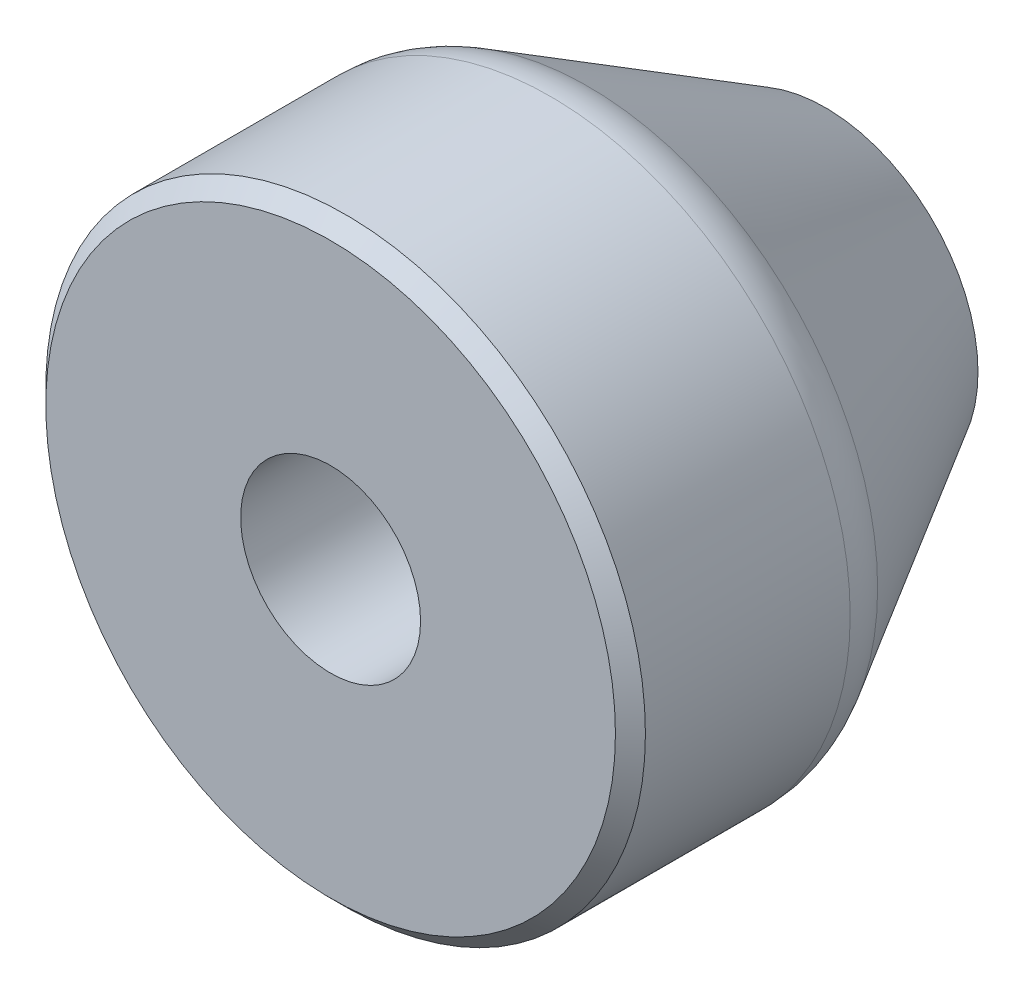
ISO-10303-21;
HEADER;
FILE_DESCRIPTION(('STEP AP214'),'2;1');
FILE_NAME('part.step','',(''),(''),'','','');
FILE_SCHEMA(('AUTOMOTIVE_DESIGN { 1 0 10303 214 1 1 1 1 }'));
ENDSEC;
DATA;
#1=APPLICATION_CONTEXT('core data for automotive mechanical design processes');
#2=APPLICATION_PROTOCOL_DEFINITION('international standard','automotive_design',2000,#1);
#3=PRODUCT_CONTEXT('',#1,'mechanical');
#4=PRODUCT('Part','Part','',(#3));
#5=PRODUCT_RELATED_PRODUCT_CATEGORY('part','',(#4));
#6=PRODUCT_DEFINITION_FORMATION('','',#4);
#7=PRODUCT_DEFINITION_CONTEXT('part definition',#1,'design');
#8=PRODUCT_DEFINITION('design','',#6,#7);
#9=PRODUCT_DEFINITION_SHAPE('','',#8);
#10=(LENGTH_UNIT() NAMED_UNIT(*) SI_UNIT(.MILLI.,.METRE.));
#11=(NAMED_UNIT(*) PLANE_ANGLE_UNIT() SI_UNIT($,.RADIAN.));
#12=(NAMED_UNIT(*) SI_UNIT($,.STERADIAN.) SOLID_ANGLE_UNIT());
#13=UNCERTAINTY_MEASURE_WITH_UNIT(LENGTH_MEASURE(1.E-05),#10,'distance_accuracy_value','');
#14=(GEOMETRIC_REPRESENTATION_CONTEXT(3) GLOBAL_UNCERTAINTY_ASSIGNED_CONTEXT((#13)) GLOBAL_UNIT_ASSIGNED_CONTEXT((#10,
#11,#12)) REPRESENTATION_CONTEXT('',''));
#15=CARTESIAN_POINT('',(0.,0.,0.));
#16=DIRECTION('',(0.,0.,1.));
#17=DIRECTION('',(1.,0.,0.));
#18=AXIS2_PLACEMENT_3D('',#15,#16,#17);
#19=CARTESIAN_POINT('',(0.,0.,18.3397459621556));
#20=DIRECTION('',(0.,0.,1.));
#21=DIRECTION('',(1.,0.,0.));
#22=AXIS2_PLACEMENT_3D('',#19,#20,#21);
#23=TOROIDAL_SURFACE('',#22,15.,5.);
#24=CARTESIAN_POINT('',(0.,0.,15.8397459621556));
#25=DIRECTION('',(0.,0.,1.));
#26=DIRECTION('',(1.,0.,0.));
#27=AXIS2_PLACEMENT_3D('',#24,#25,#26);
#28=CIRCLE('',#27,19.3301270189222);
#29=CARTESIAN_POINT('',(19.3301270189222,0.,15.8397459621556));
#30=VERTEX_POINT('',#29);
#31=EDGE_CURVE('E8',#30,#30,#28,.T.);
#32=ORIENTED_EDGE('',*,*,#31,.T.);
#33=EDGE_LOOP('',(#32));
#34=FACE_BOUND('',#33,.T.);
#35=CARTESIAN_POINT('',(0.,0.,18.3397459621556));
#36=DIRECTION('',(0.,0.,1.));
#37=DIRECTION('',(1.,0.,0.));
#38=AXIS2_PLACEMENT_3D('',#35,#36,#37);
#39=CIRCLE('',#38,20.);
#40=CARTESIAN_POINT('',(20.,0.,18.3397459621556));
#41=VERTEX_POINT('',#40);
#42=EDGE_CURVE('E37',#41,#41,#39,.T.);
#43=ORIENTED_EDGE('',*,*,#42,.F.);
#44=EDGE_LOOP('',(#43));
#45=FACE_BOUND('',#44,.T.);
#46=ADVANCED_FACE('F12',(#34,#45),#23,.T.);
#47=CARTESIAN_POINT('',(0.,0.,15.8397459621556));
#48=DIRECTION('',(0.,0.,1.));
#49=DIRECTION('',(1.,0.,0.));
#50=AXIS2_PLACEMENT_3D('',#47,#48,#49);
#51=CONICAL_SURFACE('',#50,19.3301270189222,0.523598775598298);
#52=CARTESIAN_POINT('',(0.,0.,0.));
#53=DIRECTION('',(0.,0.,1.));
#54=DIRECTION('',(1.,0.,0.));
#55=AXIS2_PLACEMENT_3D('',#52,#53,#54);
#56=CIRCLE('',#55,10.1850454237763);
#57=CARTESIAN_POINT('',(10.1850454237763,0.,0.));
#58=VERTEX_POINT('',#57);
#59=EDGE_CURVE('E18',#58,#58,#56,.T.);
#60=ORIENTED_EDGE('',*,*,#59,.T.);
#61=EDGE_LOOP('',(#60));
#62=FACE_BOUND('',#61,.T.);
#63=ORIENTED_EDGE('',*,*,#31,.F.);
#64=EDGE_LOOP('',(#63));
#65=FACE_BOUND('',#64,.T.);
#66=ADVANCED_FACE('F45',(#62,#65),#51,.T.);
#67=CARTESIAN_POINT('',(0.,-10.1850454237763,0.));
#68=DIRECTION('',(0.,0.,-1.));
#69=DIRECTION('',(-1.,0.,0.));
#70=AXIS2_PLACEMENT_3D('',#67,#68,#69);
#71=PLANE('',#70);
#72=CARTESIAN_POINT('',(0.,0.,0.));
#73=DIRECTION('',(0.,0.,1.));
#74=DIRECTION('',(1.,0.,0.));
#75=AXIS2_PLACEMENT_3D('',#72,#73,#74);
#76=CIRCLE('',#75,6.);
#77=CARTESIAN_POINT('',(6.,0.,0.));
#78=VERTEX_POINT('',#77);
#79=EDGE_CURVE('E22',#78,#78,#76,.T.);
#80=ORIENTED_EDGE('',*,*,#79,.T.);
#81=EDGE_LOOP('',(#80));
#82=FACE_BOUND('',#81,.T.);
#83=ORIENTED_EDGE('',*,*,#59,.F.);
#84=EDGE_LOOP('',(#83));
#85=FACE_BOUND('',#84,.T.);
#86=ADVANCED_FACE('F51',(#82,#85),#71,.T.);
#87=CARTESIAN_POINT('',(0.,0.,41.5949713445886));
#88=DIRECTION('',(0.,0.,1.));
#89=DIRECTION('',(1.,0.,0.));
#90=AXIS2_PLACEMENT_3D('',#87,#88,#89);
#91=CYLINDRICAL_SURFACE('',#90,6.);
#92=ORIENTED_EDGE('',*,*,#79,.F.);
#93=EDGE_LOOP('',(#92));
#94=FACE_BOUND('',#93,.T.);
#95=CARTESIAN_POINT('',(0.,0.,33.));
#96=DIRECTION('',(0.,0.,1.));
#97=DIRECTION('',(1.,0.,0.));
#98=AXIS2_PLACEMENT_3D('',#95,#96,#97);
#99=CIRCLE('',#98,6.);
#100=CARTESIAN_POINT('',(6.,0.,33.));
#101=VERTEX_POINT('',#100);
#102=EDGE_CURVE('E26',#101,#101,#99,.T.);
#103=ORIENTED_EDGE('',*,*,#102,.T.);
#104=EDGE_LOOP('',(#103));
#105=FACE_BOUND('',#104,.T.);
#106=ADVANCED_FACE('F56',(#94,#105),#91,.F.);
#107=CARTESIAN_POINT('',(0.,-6.,33.));
#108=DIRECTION('',(0.,0.,1.));
#109=DIRECTION('',(1.,0.,0.));
#110=AXIS2_PLACEMENT_3D('',#107,#108,#109);
#111=PLANE('',#110);
#112=CARTESIAN_POINT('',(0.,0.,33.));
#113=DIRECTION('',(0.,0.,1.));
#114=DIRECTION('',(1.,0.,0.));
#115=AXIS2_PLACEMENT_3D('',#112,#113,#114);
#116=CIRCLE('',#115,19.);
#117=CARTESIAN_POINT('',(19.,0.,33.));
#118=VERTEX_POINT('',#117);
#119=EDGE_CURVE('E31',#118,#118,#116,.T.);
#120=ORIENTED_EDGE('',*,*,#119,.T.);
#121=EDGE_LOOP('',(#120));
#122=FACE_BOUND('',#121,.T.);
#123=ORIENTED_EDGE('',*,*,#102,.F.);
#124=EDGE_LOOP('',(#123));
#125=FACE_BOUND('',#124,.T.);
#126=ADVANCED_FACE('F63',(#122,#125),#111,.T.);
#127=CARTESIAN_POINT('',(0.,0.,33.));
#128=DIRECTION('',(0.,0.,-1.));
#129=DIRECTION('',(-1.,0.,0.));
#130=AXIS2_PLACEMENT_3D('',#127,#128,#129);
#131=CONICAL_SURFACE('',#130,19.,0.785398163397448);
#132=CARTESIAN_POINT('',(0.,0.,32.));
#133=DIRECTION('',(0.,0.,1.));
#134=DIRECTION('',(1.,0.,0.));
#135=AXIS2_PLACEMENT_3D('',#132,#133,#134);
#136=CIRCLE('',#135,20.);
#137=CARTESIAN_POINT('',(20.,0.,32.));
#138=VERTEX_POINT('',#137);
#139=EDGE_CURVE('E34',#138,#138,#136,.T.);
#140=ORIENTED_EDGE('',*,*,#139,.T.);
#141=EDGE_LOOP('',(#140));
#142=FACE_BOUND('',#141,.T.);
#143=ORIENTED_EDGE('',*,*,#119,.F.);
#144=EDGE_LOOP('',(#143));
#145=FACE_BOUND('',#144,.T.);
#146=ADVANCED_FACE('F67',(#142,#145),#131,.T.);
#147=CARTESIAN_POINT('',(0.,0.,41.5949713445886));
#148=DIRECTION('',(0.,0.,1.));
#149=DIRECTION('',(1.,0.,0.));
#150=AXIS2_PLACEMENT_3D('',#147,#148,#149);
#151=CYLINDRICAL_SURFACE('',#150,20.);
#152=ORIENTED_EDGE('',*,*,#42,.T.);
#153=EDGE_LOOP('',(#152));
#154=FACE_BOUND('',#153,.T.);
#155=ORIENTED_EDGE('',*,*,#139,.F.);
#156=EDGE_LOOP('',(#155));
#157=FACE_BOUND('',#156,.T.);
#158=ADVANCED_FACE('F41',(#154,#157),#151,.T.);
#159=CLOSED_SHELL('',(#46,#66,#86,#106,#126,#146,#158));
#160=MANIFOLD_SOLID_BREP('B1',#159);
#161=ADVANCED_BREP_SHAPE_REPRESENTATION('',(#18,#160),#14);
#162=SHAPE_DEFINITION_REPRESENTATION(#9,#161);
ENDSEC;
END-ISO-10303-21;
